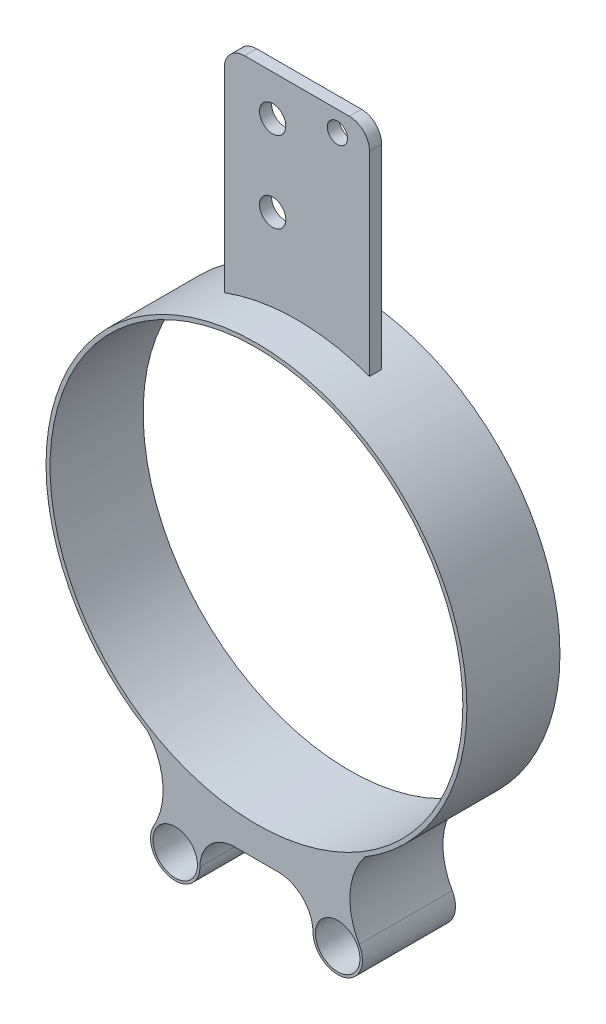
ISO-10303-21;
HEADER;
FILE_DESCRIPTION(('STEP AP214'),'2;1');
FILE_NAME('part.step','',(''),(''),'','','');
FILE_SCHEMA(('AUTOMOTIVE_DESIGN { 1 0 10303 214 1 1 1 1 }'));
ENDSEC;
DATA;
#1=APPLICATION_CONTEXT('core data for automotive mechanical design processes');
#2=APPLICATION_PROTOCOL_DEFINITION('international standard','automotive_design',2000,#1);
#3=PRODUCT_CONTEXT('',#1,'mechanical');
#4=PRODUCT('Part','Part','',(#3));
#5=PRODUCT_RELATED_PRODUCT_CATEGORY('part','',(#4));
#6=PRODUCT_DEFINITION_FORMATION('','',#4);
#7=PRODUCT_DEFINITION_CONTEXT('part definition',#1,'design');
#8=PRODUCT_DEFINITION('design','',#6,#7);
#9=PRODUCT_DEFINITION_SHAPE('','',#8);
#10=(LENGTH_UNIT() NAMED_UNIT(*) SI_UNIT(.MILLI.,.METRE.));
#11=(NAMED_UNIT(*) PLANE_ANGLE_UNIT() SI_UNIT($,.RADIAN.));
#12=(NAMED_UNIT(*) SI_UNIT($,.STERADIAN.) SOLID_ANGLE_UNIT());
#13=UNCERTAINTY_MEASURE_WITH_UNIT(LENGTH_MEASURE(1.E-05),#10,'distance_accuracy_value','');
#14=(GEOMETRIC_REPRESENTATION_CONTEXT(3) GLOBAL_UNCERTAINTY_ASSIGNED_CONTEXT((#13)) GLOBAL_UNIT_ASSIGNED_CONTEXT((#10,
#11,#12)) REPRESENTATION_CONTEXT('',''));
#15=CARTESIAN_POINT('',(0.,0.,0.));
#16=DIRECTION('',(0.,0.,1.));
#17=DIRECTION('',(1.,0.,0.));
#18=AXIS2_PLACEMENT_3D('',#15,#16,#17);
#19=CARTESIAN_POINT('',(-5.33951167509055,-67.1478656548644,23.));
#20=DIRECTION('',(0.,0.,1.));
#21=DIRECTION('',(1.,0.,0.));
#22=AXIS2_PLACEMENT_3D('',#19,#20,#21);
#23=PLANE('',#22);
#24=CARTESIAN_POINT('',(20.074423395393,-67.0303673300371,23.));
#25=DIRECTION('',(0.,0.,1.));
#26=DIRECTION('',(1.,0.,0.));
#27=AXIS2_PLACEMENT_3D('',#24,#25,#26);
#28=CIRCLE('',#27,5.5);
#29=CARTESIAN_POINT('',(25.574423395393,-67.0303673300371,23.));
#30=VERTEX_POINT('',#29);
#31=EDGE_CURVE('E234',#30,#30,#28,.T.);
#32=ORIENTED_EDGE('',*,*,#31,.F.);
#33=EDGE_LOOP('',(#32));
#34=FACE_BOUND('',#33,.T.);
#35=CARTESIAN_POINT('',(-20.074423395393,-67.0303673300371,23.));
#36=DIRECTION('',(0.,0.,1.));
#37=DIRECTION('',(1.,0.,0.));
#38=AXIS2_PLACEMENT_3D('',#35,#36,#37);
#39=CIRCLE('',#38,5.5);
#40=CARTESIAN_POINT('',(-14.574423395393,-67.0303673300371,23.));
#41=VERTEX_POINT('',#40);
#42=EDGE_CURVE('E223',#41,#41,#39,.T.);
#43=ORIENTED_EDGE('',*,*,#42,.F.);
#44=EDGE_LOOP('',(#43));
#45=FACE_BOUND('',#44,.T.);
#46=CARTESIAN_POINT('',(-5.33951167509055,-67.1478656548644,23.));
#47=DIRECTION('',(0.,0.,-1.));
#48=DIRECTION('',(1.,0.,0.));
#49=AXIS2_PLACEMENT_3D('',#46,#47,#48);
#50=CIRCLE('',#49,8.62670734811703);
#51=CARTESIAN_POINT('',(-13.9659447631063,-67.0790772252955,23.));
#52=VERTEX_POINT('',#51);
#53=CARTESIAN_POINT('',(-5.26383092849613,-58.5214902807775,23.));
#54=VERTEX_POINT('',#53);
#55=EDGE_CURVE('E168',#52,#54,#50,.T.);
#56=ORIENTED_EDGE('',*,*,#55,.T.);
#57=DIRECTION('',(1.,0.,0.));
#58=VECTOR('',#57,1.);
#59=CARTESIAN_POINT('',(-5.26383092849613,-58.5214902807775,23.));
#60=LINE('',#59,#58);
#61=CARTESIAN_POINT('',(5.26383092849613,-58.5214902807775,23.));
#62=VERTEX_POINT('',#61);
#63=EDGE_CURVE('E171',#54,#62,#60,.T.);
#64=ORIENTED_EDGE('',*,*,#63,.T.);
#65=CARTESIAN_POINT('',(5.33951167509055,-67.1478656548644,23.));
#66=DIRECTION('',(0.,0.,-1.));
#67=DIRECTION('',(-1.,0.,0.));
#68=AXIS2_PLACEMENT_3D('',#65,#66,#67);
#69=CIRCLE('',#68,8.62670734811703);
#70=CARTESIAN_POINT('',(13.9659447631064,-67.0790772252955,23.));
#71=VERTEX_POINT('',#70);
#72=EDGE_CURVE('E174',#62,#71,#69,.T.);
#73=ORIENTED_EDGE('',*,*,#72,.T.);
#74=CARTESIAN_POINT('',(20.074423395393,-67.0303673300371,23.));
#75=DIRECTION('',(0.,0.,1.));
#76=DIRECTION('',(1.,0.,0.));
#77=AXIS2_PLACEMENT_3D('',#74,#75,#76);
#78=CIRCLE('',#77,6.10867283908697);
#79=CARTESIAN_POINT('',(25.3779090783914,-63.9990436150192,23.));
#80=VERTEX_POINT('',#79);
#81=EDGE_CURVE('E176',#71,#80,#78,.T.);
#82=ORIENTED_EDGE('',*,*,#81,.T.);
#83=CARTESIAN_POINT('',(40.512535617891,-55.3485154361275,23.));
#84=DIRECTION('',(0.,0.,-1.));
#85=DIRECTION('',(-1.,0.,0.));
#86=AXIS2_PLACEMENT_3D('',#83,#84,#85);
#87=CIRCLE('',#86,17.432399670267);
#88=CARTESIAN_POINT('',(26.834522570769,-44.5410866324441,23.));
#89=VERTEX_POINT('',#88);
#90=EDGE_CURVE('E178',#80,#89,#87,.T.);
#91=ORIENTED_EDGE('',*,*,#90,.T.);
#92=CARTESIAN_POINT('',(0.,0.,23.));
#93=DIRECTION('',(0.,0.,1.));
#94=DIRECTION('',(1.,0.,0.));
#95=AXIS2_PLACEMENT_3D('',#92,#93,#94);
#96=CIRCLE('',#95,52.);
#97=CARTESIAN_POINT('',(-26.834522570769,-44.5410866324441,23.));
#98=VERTEX_POINT('',#97);
#99=EDGE_CURVE('E180',#89,#98,#96,.T.);
#100=ORIENTED_EDGE('',*,*,#99,.T.);
#101=CARTESIAN_POINT('',(-40.512535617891,-55.3485154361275,23.));
#102=DIRECTION('',(0.,0.,-1.));
#103=DIRECTION('',(1.,0.,0.));
#104=AXIS2_PLACEMENT_3D('',#101,#102,#103);
#105=CIRCLE('',#104,17.432399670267);
#106=CARTESIAN_POINT('',(-25.3779090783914,-63.9990436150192,23.));
#107=VERTEX_POINT('',#106);
#108=EDGE_CURVE('E182',#98,#107,#105,.T.);
#109=ORIENTED_EDGE('',*,*,#108,.T.);
#110=CARTESIAN_POINT('',(-20.074423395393,-67.0303673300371,23.));
#111=DIRECTION('',(0.,0.,1.));
#112=DIRECTION('',(-1.,0.,0.));
#113=AXIS2_PLACEMENT_3D('',#110,#111,#112);
#114=CIRCLE('',#113,6.10867283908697);
#115=EDGE_CURVE('E184',#107,#52,#114,.T.);
#116=ORIENTED_EDGE('',*,*,#115,.T.);
#117=EDGE_LOOP('',(#56,#64,#73,#82,#91,#100,#109,#116));
#118=FACE_BOUND('',#117,.T.);
#119=CARTESIAN_POINT('',(0.,0.,23.));
#120=DIRECTION('',(0.,0.,1.));
#121=DIRECTION('',(1.,0.,0.));
#122=AXIS2_PLACEMENT_3D('',#119,#120,#121);
#123=CIRCLE('',#122,51.);
#124=CARTESIAN_POINT('',(51.,0.,23.));
#125=VERTEX_POINT('',#124);
#126=EDGE_CURVE('E159',#125,#125,#123,.T.);
#127=ORIENTED_EDGE('',*,*,#126,.F.);
#128=EDGE_LOOP('',(#127));
#129=FACE_BOUND('',#128,.T.);
#130=ADVANCED_FACE('F33',(#34,#45,#118,#129),#23,.T.);
#131=CARTESIAN_POINT('',(-5.33951167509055,-67.1478656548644,0.));
#132=DIRECTION('',(0.,0.,1.));
#133=DIRECTION('',(1.,0.,0.));
#134=AXIS2_PLACEMENT_3D('',#131,#132,#133);
#135=PLANE('',#134);
#136=CARTESIAN_POINT('',(20.074423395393,-67.0303673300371,0.));
#137=DIRECTION('',(0.,0.,1.));
#138=DIRECTION('',(1.,0.,0.));
#139=AXIS2_PLACEMENT_3D('',#136,#137,#138);
#140=CIRCLE('',#139,5.5);
#141=CARTESIAN_POINT('',(25.574423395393,-67.0303673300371,0.));
#142=VERTEX_POINT('',#141);
#143=EDGE_CURVE('E37',#142,#142,#140,.T.);
#144=ORIENTED_EDGE('',*,*,#143,.T.);
#145=EDGE_LOOP('',(#144));
#146=FACE_BOUND('',#145,.T.);
#147=CARTESIAN_POINT('',(-20.074423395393,-67.0303673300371,0.));
#148=DIRECTION('',(0.,0.,1.));
#149=DIRECTION('',(1.,0.,0.));
#150=AXIS2_PLACEMENT_3D('',#147,#148,#149);
#151=CIRCLE('',#150,5.5);
#152=CARTESIAN_POINT('',(-14.574423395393,-67.0303673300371,0.));
#153=VERTEX_POINT('',#152);
#154=EDGE_CURVE('E220',#153,#153,#151,.T.);
#155=ORIENTED_EDGE('',*,*,#154,.T.);
#156=EDGE_LOOP('',(#155));
#157=FACE_BOUND('',#156,.T.);
#158=CARTESIAN_POINT('',(-5.33951167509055,-67.1478656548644,0.));
#159=DIRECTION('',(0.,0.,-1.));
#160=DIRECTION('',(1.,0.,0.));
#161=AXIS2_PLACEMENT_3D('',#158,#159,#160);
#162=CIRCLE('',#161,8.62670734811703);
#163=CARTESIAN_POINT('',(-13.9659447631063,-67.0790772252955,0.));
#164=VERTEX_POINT('',#163);
#165=CARTESIAN_POINT('',(-5.26383092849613,-58.5214902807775,0.));
#166=VERTEX_POINT('',#165);
#167=EDGE_CURVE('E166',#164,#166,#162,.T.);
#168=ORIENTED_EDGE('',*,*,#167,.F.);
#169=CARTESIAN_POINT('',(-20.074423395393,-67.0303673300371,0.));
#170=DIRECTION('',(0.,0.,1.));
#171=DIRECTION('',(-1.,0.,0.));
#172=AXIS2_PLACEMENT_3D('',#169,#170,#171);
#173=CIRCLE('',#172,6.10867283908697);
#174=CARTESIAN_POINT('',(-25.3779090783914,-63.9990436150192,0.));
#175=VERTEX_POINT('',#174);
#176=EDGE_CURVE('E172',#175,#164,#173,.T.);
#177=ORIENTED_EDGE('',*,*,#176,.F.);
#178=CARTESIAN_POINT('',(-40.512535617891,-55.3485154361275,0.));
#179=DIRECTION('',(0.,0.,-1.));
#180=DIRECTION('',(1.,0.,0.));
#181=AXIS2_PLACEMENT_3D('',#178,#179,#180);
#182=CIRCLE('',#181,17.432399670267);
#183=CARTESIAN_POINT('',(-26.834522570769,-44.5410866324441,0.));
#184=VERTEX_POINT('',#183);
#185=EDGE_CURVE('E199',#184,#175,#182,.T.);
#186=ORIENTED_EDGE('',*,*,#185,.F.);
#187=CARTESIAN_POINT('',(0.,0.,0.));
#188=DIRECTION('',(0.,0.,1.));
#189=DIRECTION('',(1.,0.,0.));
#190=AXIS2_PLACEMENT_3D('',#187,#188,#189);
#191=CIRCLE('',#190,52.);
#192=CARTESIAN_POINT('',(26.834522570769,-44.5410866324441,0.));
#193=VERTEX_POINT('',#192);
#194=EDGE_CURVE('E197',#193,#184,#191,.T.);
#195=ORIENTED_EDGE('',*,*,#194,.F.);
#196=CARTESIAN_POINT('',(40.512535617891,-55.3485154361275,0.));
#197=DIRECTION('',(0.,0.,-1.));
#198=DIRECTION('',(-1.,0.,0.));
#199=AXIS2_PLACEMENT_3D('',#196,#197,#198);
#200=CIRCLE('',#199,17.432399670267);
#201=CARTESIAN_POINT('',(25.3779090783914,-63.9990436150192,0.));
#202=VERTEX_POINT('',#201);
#203=EDGE_CURVE('E195',#202,#193,#200,.T.);
#204=ORIENTED_EDGE('',*,*,#203,.F.);
#205=CARTESIAN_POINT('',(20.074423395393,-67.0303673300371,0.));
#206=DIRECTION('',(0.,0.,1.));
#207=DIRECTION('',(1.,0.,0.));
#208=AXIS2_PLACEMENT_3D('',#205,#206,#207);
#209=CIRCLE('',#208,6.10867283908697);
#210=CARTESIAN_POINT('',(13.9659447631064,-67.0790772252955,0.));
#211=VERTEX_POINT('',#210);
#212=EDGE_CURVE('E193',#211,#202,#209,.T.);
#213=ORIENTED_EDGE('',*,*,#212,.F.);
#214=CARTESIAN_POINT('',(5.33951167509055,-67.1478656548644,0.));
#215=DIRECTION('',(0.,0.,-1.));
#216=DIRECTION('',(-1.,0.,0.));
#217=AXIS2_PLACEMENT_3D('',#214,#215,#216);
#218=CIRCLE('',#217,8.62670734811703);
#219=CARTESIAN_POINT('',(5.26383092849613,-58.5214902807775,0.));
#220=VERTEX_POINT('',#219);
#221=EDGE_CURVE('E191',#220,#211,#218,.T.);
#222=ORIENTED_EDGE('',*,*,#221,.F.);
#223=DIRECTION('',(1.,0.,0.));
#224=VECTOR('',#223,1.);
#225=CARTESIAN_POINT('',(-5.26383092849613,-58.5214902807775,0.));
#226=LINE('',#225,#224);
#227=EDGE_CURVE('E189',#166,#220,#226,.T.);
#228=ORIENTED_EDGE('',*,*,#227,.F.);
#229=EDGE_LOOP('',(#168,#177,#186,#195,#204,#213,#222,#228));
#230=FACE_BOUND('',#229,.T.);
#231=CARTESIAN_POINT('',(0.,0.,0.));
#232=DIRECTION('',(0.,0.,1.));
#233=DIRECTION('',(1.,0.,0.));
#234=AXIS2_PLACEMENT_3D('',#231,#232,#233);
#235=CIRCLE('',#234,51.);
#236=CARTESIAN_POINT('',(51.,0.,0.));
#237=VERTEX_POINT('',#236);
#238=EDGE_CURVE('E156',#237,#237,#235,.T.);
#239=ORIENTED_EDGE('',*,*,#238,.T.);
#240=EDGE_LOOP('',(#239));
#241=FACE_BOUND('',#240,.T.);
#242=ADVANCED_FACE('F299',(#146,#157,#230,#241),#135,.F.);
#243=CARTESIAN_POINT('',(-5.33951167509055,-67.1478656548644,23.));
#244=DIRECTION('',(0.,0.,-1.));
#245=DIRECTION('',(-1.,0.,0.));
#246=AXIS2_PLACEMENT_3D('',#243,#244,#245);
#247=CYLINDRICAL_SURFACE('',#246,8.62670734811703);
#248=ORIENTED_EDGE('',*,*,#167,.T.);
#249=DIRECTION('',(0.,0.,-1.));
#250=VECTOR('',#249,1.);
#251=CARTESIAN_POINT('',(-5.26383092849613,-58.5214902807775,23.));
#252=LINE('',#251,#250);
#253=EDGE_CURVE('E11',#54,#166,#252,.T.);
#254=ORIENTED_EDGE('',*,*,#253,.F.);
#255=ORIENTED_EDGE('',*,*,#55,.F.);
#256=DIRECTION('',(0.,0.,-1.));
#257=VECTOR('',#256,1.);
#258=CARTESIAN_POINT('',(-13.9659447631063,-67.0790772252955,23.));
#259=LINE('',#258,#257);
#260=EDGE_CURVE('E186',#52,#164,#259,.T.);
#261=ORIENTED_EDGE('',*,*,#260,.T.);
#262=EDGE_LOOP('',(#248,#254,#255,#261));
#263=FACE_BOUND('',#262,.T.);
#264=ADVANCED_FACE('F35',(#263),#247,.F.);
#265=CARTESIAN_POINT('',(-5.26383092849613,-58.5214902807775,23.));
#266=DIRECTION('',(0.,1.,0.));
#267=DIRECTION('',(0.,0.,1.));
#268=AXIS2_PLACEMENT_3D('',#265,#266,#267);
#269=PLANE('',#268);
#270=ORIENTED_EDGE('',*,*,#227,.T.);
#271=DIRECTION('',(0.,0.,-1.));
#272=VECTOR('',#271,1.);
#273=CARTESIAN_POINT('',(5.26383092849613,-58.5214902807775,23.));
#274=LINE('',#273,#272);
#275=EDGE_CURVE('E42',#62,#220,#274,.T.);
#276=ORIENTED_EDGE('',*,*,#275,.F.);
#277=ORIENTED_EDGE('',*,*,#63,.F.);
#278=ORIENTED_EDGE('',*,*,#253,.T.);
#279=EDGE_LOOP('',(#270,#276,#277,#278));
#280=FACE_BOUND('',#279,.T.);
#281=ADVANCED_FACE('F334',(#280),#269,.F.);
#282=CARTESIAN_POINT('',(5.33951167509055,-67.1478656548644,23.));
#283=DIRECTION('',(0.,0.,-1.));
#284=DIRECTION('',(-1.,0.,0.));
#285=AXIS2_PLACEMENT_3D('',#282,#283,#284);
#286=CYLINDRICAL_SURFACE('',#285,8.62670734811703);
#287=ORIENTED_EDGE('',*,*,#221,.T.);
#288=DIRECTION('',(0.,0.,-1.));
#289=VECTOR('',#288,1.);
#290=CARTESIAN_POINT('',(13.9659447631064,-67.0790772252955,23.));
#291=LINE('',#290,#289);
#292=EDGE_CURVE('E216',#71,#211,#291,.T.);
#293=ORIENTED_EDGE('',*,*,#292,.F.);
#294=ORIENTED_EDGE('',*,*,#72,.F.);
#295=ORIENTED_EDGE('',*,*,#275,.T.);
#296=EDGE_LOOP('',(#287,#293,#294,#295));
#297=FACE_BOUND('',#296,.T.);
#298=ADVANCED_FACE('F331',(#297),#286,.F.);
#299=CARTESIAN_POINT('',(20.074423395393,-67.0303673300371,23.));
#300=DIRECTION('',(0.,0.,-1.));
#301=DIRECTION('',(-1.,0.,0.));
#302=AXIS2_PLACEMENT_3D('',#299,#300,#301);
#303=CYLINDRICAL_SURFACE('',#302,6.10867283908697);
#304=ORIENTED_EDGE('',*,*,#212,.T.);
#305=DIRECTION('',(0.,0.,-1.));
#306=VECTOR('',#305,1.);
#307=CARTESIAN_POINT('',(25.3779090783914,-63.9990436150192,23.));
#308=LINE('',#307,#306);
#309=EDGE_CURVE('E213',#80,#202,#308,.T.);
#310=ORIENTED_EDGE('',*,*,#309,.F.);
#311=ORIENTED_EDGE('',*,*,#81,.F.);
#312=ORIENTED_EDGE('',*,*,#292,.T.);
#313=EDGE_LOOP('',(#304,#310,#311,#312));
#314=FACE_BOUND('',#313,.T.);
#315=ADVANCED_FACE('F327',(#314),#303,.T.);
#316=CARTESIAN_POINT('',(40.512535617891,-55.3485154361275,23.));
#317=DIRECTION('',(0.,0.,-1.));
#318=DIRECTION('',(-1.,0.,0.));
#319=AXIS2_PLACEMENT_3D('',#316,#317,#318);
#320=CYLINDRICAL_SURFACE('',#319,17.432399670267);
#321=ORIENTED_EDGE('',*,*,#203,.T.);
#322=DIRECTION('',(0.,0.,-1.));
#323=VECTOR('',#322,1.);
#324=CARTESIAN_POINT('',(26.834522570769,-44.5410866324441,23.));
#325=LINE('',#324,#323);
#326=EDGE_CURVE('E210',#89,#193,#325,.T.);
#327=ORIENTED_EDGE('',*,*,#326,.F.);
#328=ORIENTED_EDGE('',*,*,#90,.F.);
#329=ORIENTED_EDGE('',*,*,#309,.T.);
#330=EDGE_LOOP('',(#321,#327,#328,#329));
#331=FACE_BOUND('',#330,.T.);
#332=ADVANCED_FACE('F324',(#331),#320,.F.);
#333=CARTESIAN_POINT('',(0.,0.,23.));
#334=DIRECTION('',(0.,0.,-1.));
#335=DIRECTION('',(-1.,0.,0.));
#336=AXIS2_PLACEMENT_3D('',#333,#334,#335);
#337=CYLINDRICAL_SURFACE('',#336,52.);
#338=DIRECTION('',(0.,0.,-1.));
#339=VECTOR('',#338,1.);
#340=CARTESIAN_POINT('',(17.9396464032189,48.807469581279,13.));
#341=LINE('',#340,#339);
#342=CARTESIAN_POINT('',(17.9396464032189,48.807469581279,13.));
#343=VERTEX_POINT('',#342);
#344=CARTESIAN_POINT('',(17.9396464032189,48.807469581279,10.));
#345=VERTEX_POINT('',#344);
#346=EDGE_CURVE('E50',#343,#345,#341,.T.);
#347=ORIENTED_EDGE('',*,*,#346,.F.);
#348=CARTESIAN_POINT('',(0.,0.,13.));
#349=DIRECTION('',(0.,0.,1.));
#350=DIRECTION('',(1.,0.,0.));
#351=AXIS2_PLACEMENT_3D('',#348,#349,#350);
#352=CIRCLE('',#351,52.);
#353=CARTESIAN_POINT('',(-17.9396464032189,48.807469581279,13.));
#354=VERTEX_POINT('',#353);
#355=EDGE_CURVE('E55',#343,#354,#352,.T.);
#356=ORIENTED_EDGE('',*,*,#355,.T.);
#357=DIRECTION('',(0.,0.,-1.));
#358=VECTOR('',#357,1.);
#359=CARTESIAN_POINT('',(-17.9396464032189,48.807469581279,13.));
#360=LINE('',#359,#358);
#361=CARTESIAN_POINT('',(-17.9396464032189,48.807469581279,10.));
#362=VERTEX_POINT('',#361);
#363=EDGE_CURVE('E272',#354,#362,#360,.T.);
#364=ORIENTED_EDGE('',*,*,#363,.T.);
#365=CARTESIAN_POINT('',(0.,0.,10.));
#366=DIRECTION('',(0.,0.,1.));
#367=DIRECTION('',(1.,0.,0.));
#368=AXIS2_PLACEMENT_3D('',#365,#366,#367);
#369=CIRCLE('',#368,52.);
#370=EDGE_CURVE('E241',#345,#362,#369,.T.);
#371=ORIENTED_EDGE('',*,*,#370,.F.);
#372=EDGE_LOOP('',(#347,#356,#364,#371));
#373=FACE_BOUND('',#372,.T.);
#374=ORIENTED_EDGE('',*,*,#194,.T.);
#375=DIRECTION('',(0.,0.,-1.));
#376=VECTOR('',#375,1.);
#377=CARTESIAN_POINT('',(-26.834522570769,-44.5410866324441,23.));
#378=LINE('',#377,#376);
#379=EDGE_CURVE('E207',#98,#184,#378,.T.);
#380=ORIENTED_EDGE('',*,*,#379,.F.);
#381=ORIENTED_EDGE('',*,*,#99,.F.);
#382=ORIENTED_EDGE('',*,*,#326,.T.);
#383=EDGE_LOOP('',(#374,#380,#381,#382));
#384=FACE_BOUND('',#383,.T.);
#385=ADVANCED_FACE('F320',(#373,#384),#337,.T.);
#386=CARTESIAN_POINT('',(-40.512535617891,-55.3485154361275,23.));
#387=DIRECTION('',(0.,0.,-1.));
#388=DIRECTION('',(-1.,0.,0.));
#389=AXIS2_PLACEMENT_3D('',#386,#387,#388);
#390=CYLINDRICAL_SURFACE('',#389,17.432399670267);
#391=ORIENTED_EDGE('',*,*,#185,.T.);
#392=DIRECTION('',(0.,0.,-1.));
#393=VECTOR('',#392,1.);
#394=CARTESIAN_POINT('',(-25.3779090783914,-63.9990436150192,23.));
#395=LINE('',#394,#393);
#396=EDGE_CURVE('E204',#107,#175,#395,.T.);
#397=ORIENTED_EDGE('',*,*,#396,.F.);
#398=ORIENTED_EDGE('',*,*,#108,.F.);
#399=ORIENTED_EDGE('',*,*,#379,.T.);
#400=EDGE_LOOP('',(#391,#397,#398,#399));
#401=FACE_BOUND('',#400,.T.);
#402=ADVANCED_FACE('F316',(#401),#390,.F.);
#403=CARTESIAN_POINT('',(-20.074423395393,-67.0303673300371,23.));
#404=DIRECTION('',(0.,0.,-1.));
#405=DIRECTION('',(-1.,0.,0.));
#406=AXIS2_PLACEMENT_3D('',#403,#404,#405);
#407=CYLINDRICAL_SURFACE('',#406,6.10867283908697);
#408=ORIENTED_EDGE('',*,*,#176,.T.);
#409=ORIENTED_EDGE('',*,*,#260,.F.);
#410=ORIENTED_EDGE('',*,*,#115,.F.);
#411=ORIENTED_EDGE('',*,*,#396,.T.);
#412=EDGE_LOOP('',(#408,#409,#410,#411));
#413=FACE_BOUND('',#412,.T.);
#414=ADVANCED_FACE('F313',(#413),#407,.T.);
#415=CARTESIAN_POINT('',(0.,0.,23.));
#416=DIRECTION('',(0.,0.,-1.));
#417=DIRECTION('',(-1.,0.,0.));
#418=AXIS2_PLACEMENT_3D('',#415,#416,#417);
#419=CYLINDRICAL_SURFACE('',#418,51.);
#420=ORIENTED_EDGE('',*,*,#126,.T.);
#421=EDGE_LOOP('',(#420));
#422=FACE_BOUND('',#421,.T.);
#423=ORIENTED_EDGE('',*,*,#238,.F.);
#424=EDGE_LOOP('',(#423));
#425=FACE_BOUND('',#424,.T.);
#426=ADVANCED_FACE('F310',(#422,#425),#419,.F.);
#427=CARTESIAN_POINT('',(17.9396464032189,-115.899434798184,13.));
#428=DIRECTION('',(-1.,0.,0.));
#429=DIRECTION('',(0.,0.,1.));
#430=AXIS2_PLACEMENT_3D('',#427,#428,#429);
#431=PLANE('',#430);
#432=DIRECTION('',(0.,1.,0.));
#433=VECTOR('',#432,1.);
#434=CARTESIAN_POINT('',(17.9396464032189,-115.899434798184,10.));
#435=LINE('',#434,#433);
#436=CARTESIAN_POINT('',(17.9396464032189,97.,10.));
#437=VERTEX_POINT('',#436);
#438=EDGE_CURVE('E155',#345,#437,#435,.T.);
#439=ORIENTED_EDGE('',*,*,#438,.T.);
#440=DIRECTION('',(0.,0.,-1.));
#441=VECTOR('',#440,1.);
#442=CARTESIAN_POINT('',(17.9396464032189,97.,13.));
#443=LINE('',#442,#441);
#444=CARTESIAN_POINT('',(17.9396464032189,97.,13.));
#445=VERTEX_POINT('',#444);
#446=EDGE_CURVE('E139',#445,#437,#443,.T.);
#447=ORIENTED_EDGE('',*,*,#446,.F.);
#448=DIRECTION('',(0.,1.,0.));
#449=VECTOR('',#448,1.);
#450=CARTESIAN_POINT('',(17.9396464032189,-115.899434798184,13.));
#451=LINE('',#450,#449);
#452=EDGE_CURVE('E146',#343,#445,#451,.T.);
#453=ORIENTED_EDGE('',*,*,#452,.F.);
#454=ORIENTED_EDGE('',*,*,#346,.T.);
#455=EDGE_LOOP('',(#439,#447,#453,#454));
#456=FACE_BOUND('',#455,.T.);
#457=ADVANCED_FACE('F153',(#456),#431,.F.);
#458=CARTESIAN_POINT('',(12.9396464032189,97.,13.));
#459=DIRECTION('',(0.,0.,-1.));
#460=DIRECTION('',(-1.,0.,0.));
#461=AXIS2_PLACEMENT_3D('',#458,#459,#460);
#462=CYLINDRICAL_SURFACE('',#461,5.);
#463=CARTESIAN_POINT('',(12.9396464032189,97.,10.));
#464=DIRECTION('',(0.,0.,1.));
#465=DIRECTION('',(1.,0.,0.));
#466=AXIS2_PLACEMENT_3D('',#463,#464,#465);
#467=CIRCLE('',#466,5.);
#468=CARTESIAN_POINT('',(12.9396464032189,102.,10.));
#469=VERTEX_POINT('',#468);
#470=EDGE_CURVE('E259',#437,#469,#467,.T.);
#471=ORIENTED_EDGE('',*,*,#470,.T.);
#472=DIRECTION('',(0.,0.,-1.));
#473=VECTOR('',#472,1.);
#474=CARTESIAN_POINT('',(12.9396464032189,102.,13.));
#475=LINE('',#474,#473);
#476=CARTESIAN_POINT('',(12.9396464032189,102.,13.));
#477=VERTEX_POINT('',#476);
#478=EDGE_CURVE('E142',#477,#469,#475,.T.);
#479=ORIENTED_EDGE('',*,*,#478,.F.);
#480=CARTESIAN_POINT('',(12.9396464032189,97.,13.));
#481=DIRECTION('',(0.,0.,1.));
#482=DIRECTION('',(1.,0.,0.));
#483=AXIS2_PLACEMENT_3D('',#480,#481,#482);
#484=CIRCLE('',#483,5.);
#485=EDGE_CURVE('E135',#445,#477,#484,.T.);
#486=ORIENTED_EDGE('',*,*,#485,.F.);
#487=ORIENTED_EDGE('',*,*,#446,.T.);
#488=EDGE_LOOP('',(#471,#479,#486,#487));
#489=FACE_BOUND('',#488,.T.);
#490=ADVANCED_FACE('F137',(#489),#462,.T.);
#491=CARTESIAN_POINT('',(0.,102.,13.));
#492=DIRECTION('',(0.,-1.,0.));
#493=DIRECTION('',(0.,0.,-1.));
#494=AXIS2_PLACEMENT_3D('',#491,#492,#493);
#495=PLANE('',#494);
#496=DIRECTION('',(-1.,0.,0.));
#497=VECTOR('',#496,1.);
#498=CARTESIAN_POINT('',(0.,102.,10.));
#499=LINE('',#498,#497);
#500=CARTESIAN_POINT('',(-12.9396464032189,102.,10.));
#501=VERTEX_POINT('',#500);
#502=EDGE_CURVE('E261',#469,#501,#499,.T.);
#503=ORIENTED_EDGE('',*,*,#502,.T.);
#504=DIRECTION('',(0.,0.,-1.));
#505=VECTOR('',#504,1.);
#506=CARTESIAN_POINT('',(-12.9396464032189,102.,13.));
#507=LINE('',#506,#505);
#508=CARTESIAN_POINT('',(-12.9396464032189,102.,13.));
#509=VERTEX_POINT('',#508);
#510=EDGE_CURVE('E161',#509,#501,#507,.T.);
#511=ORIENTED_EDGE('',*,*,#510,.F.);
#512=DIRECTION('',(-1.,0.,0.));
#513=VECTOR('',#512,1.);
#514=CARTESIAN_POINT('',(0.,102.,13.));
#515=LINE('',#514,#513);
#516=EDGE_CURVE('E145',#477,#509,#515,.T.);
#517=ORIENTED_EDGE('',*,*,#516,.F.);
#518=ORIENTED_EDGE('',*,*,#478,.T.);
#519=EDGE_LOOP('',(#503,#511,#517,#518));
#520=FACE_BOUND('',#519,.T.);
#521=ADVANCED_FACE('F289',(#520),#495,.F.);
#522=CARTESIAN_POINT('',(-12.9396464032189,97.,13.));
#523=DIRECTION('',(0.,0.,-1.));
#524=DIRECTION('',(-1.,0.,0.));
#525=AXIS2_PLACEMENT_3D('',#522,#523,#524);
#526=CYLINDRICAL_SURFACE('',#525,5.);
#527=CARTESIAN_POINT('',(-12.9396464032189,97.,10.));
#528=DIRECTION('',(0.,0.,1.));
#529=DIRECTION('',(1.,0.,0.));
#530=AXIS2_PLACEMENT_3D('',#527,#528,#529);
#531=CIRCLE('',#530,5.);
#532=CARTESIAN_POINT('',(-17.9396464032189,97.,10.));
#533=VERTEX_POINT('',#532);
#534=EDGE_CURVE('E263',#501,#533,#531,.T.);
#535=ORIENTED_EDGE('',*,*,#534,.T.);
#536=DIRECTION('',(0.,0.,-1.));
#537=VECTOR('',#536,1.);
#538=CARTESIAN_POINT('',(-17.9396464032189,97.,13.));
#539=LINE('',#538,#537);
#540=CARTESIAN_POINT('',(-17.9396464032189,97.,13.));
#541=VERTEX_POINT('',#540);
#542=EDGE_CURVE('E274',#541,#533,#539,.T.);
#543=ORIENTED_EDGE('',*,*,#542,.F.);
#544=CARTESIAN_POINT('',(-12.9396464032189,97.,13.));
#545=DIRECTION('',(0.,0.,1.));
#546=DIRECTION('',(1.,0.,0.));
#547=AXIS2_PLACEMENT_3D('',#544,#545,#546);
#548=CIRCLE('',#547,5.);
#549=EDGE_CURVE('E247',#509,#541,#548,.T.);
#550=ORIENTED_EDGE('',*,*,#549,.F.);
#551=ORIENTED_EDGE('',*,*,#510,.T.);
#552=EDGE_LOOP('',(#535,#543,#550,#551));
#553=FACE_BOUND('',#552,.T.);
#554=ADVANCED_FACE('F280',(#553),#526,.T.);
#555=CARTESIAN_POINT('',(-17.9396464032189,-115.899434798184,13.));
#556=DIRECTION('',(-1.,0.,0.));
#557=DIRECTION('',(0.,0.,1.));
#558=AXIS2_PLACEMENT_3D('',#555,#556,#557);
#559=PLANE('',#558);
#560=DIRECTION('',(0.,1.,0.));
#561=VECTOR('',#560,1.);
#562=CARTESIAN_POINT('',(-17.9396464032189,-115.899434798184,10.));
#563=LINE('',#562,#561);
#564=EDGE_CURVE('E266',#362,#533,#563,.T.);
#565=ORIENTED_EDGE('',*,*,#564,.F.);
#566=ORIENTED_EDGE('',*,*,#363,.F.);
#567=DIRECTION('',(0.,1.,0.));
#568=VECTOR('',#567,1.);
#569=CARTESIAN_POINT('',(-17.9396464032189,-115.899434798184,13.));
#570=LINE('',#569,#568);
#571=EDGE_CURVE('E249',#354,#541,#570,.T.);
#572=ORIENTED_EDGE('',*,*,#571,.T.);
#573=ORIENTED_EDGE('',*,*,#542,.T.);
#574=EDGE_LOOP('',(#565,#566,#572,#573));
#575=FACE_BOUND('',#574,.T.);
#576=ADVANCED_FACE('F288',(#575),#559,.T.);
#577=CARTESIAN_POINT('',(10.,97.,13.));
#578=DIRECTION('',(0.,0.,-1.));
#579=DIRECTION('',(-1.,0.,0.));
#580=AXIS2_PLACEMENT_3D('',#577,#578,#579);
#581=CYLINDRICAL_SURFACE('',#580,2.5);
#582=CARTESIAN_POINT('',(10.,97.,13.));
#583=DIRECTION('',(0.,0.,1.));
#584=DIRECTION('',(1.,0.,0.));
#585=AXIS2_PLACEMENT_3D('',#582,#583,#584);
#586=CIRCLE('',#585,2.5);
#587=CARTESIAN_POINT('',(12.5,97.,13.));
#588=VERTEX_POINT('',#587);
#589=EDGE_CURVE('E151',#588,#588,#586,.T.);
#590=ORIENTED_EDGE('',*,*,#589,.T.);
#591=EDGE_LOOP('',(#590));
#592=FACE_BOUND('',#591,.T.);
#593=CARTESIAN_POINT('',(10.,97.,10.));
#594=DIRECTION('',(0.,0.,1.));
#595=DIRECTION('',(1.,0.,0.));
#596=AXIS2_PLACEMENT_3D('',#593,#594,#595);
#597=CIRCLE('',#596,2.5);
#598=CARTESIAN_POINT('',(12.5,97.,10.));
#599=VERTEX_POINT('',#598);
#600=EDGE_CURVE('E255',#599,#599,#597,.T.);
#601=ORIENTED_EDGE('',*,*,#600,.F.);
#602=EDGE_LOOP('',(#601));
#603=FACE_BOUND('',#602,.T.);
#604=ADVANCED_FACE('F381',(#592,#603),#581,.F.);
#605=CARTESIAN_POINT('',(-6.,92.,13.));
#606=DIRECTION('',(0.,0.,-1.));
#607=DIRECTION('',(-1.,0.,0.));
#608=AXIS2_PLACEMENT_3D('',#605,#606,#607);
#609=CYLINDRICAL_SURFACE('',#608,3.25);
#610=CARTESIAN_POINT('',(-6.,92.,13.));
#611=DIRECTION('',(0.,0.,1.));
#612=DIRECTION('',(1.,0.,0.));
#613=AXIS2_PLACEMENT_3D('',#610,#611,#612);
#614=CIRCLE('',#613,3.25);
#615=CARTESIAN_POINT('',(-2.75,92.,13.));
#616=VERTEX_POINT('',#615);
#617=EDGE_CURVE('E240',#616,#616,#614,.T.);
#618=ORIENTED_EDGE('',*,*,#617,.T.);
#619=EDGE_LOOP('',(#618));
#620=FACE_BOUND('',#619,.T.);
#621=CARTESIAN_POINT('',(-6.,92.,10.));
#622=DIRECTION('',(0.,0.,1.));
#623=DIRECTION('',(1.,0.,0.));
#624=AXIS2_PLACEMENT_3D('',#621,#622,#623);
#625=CIRCLE('',#624,3.25);
#626=CARTESIAN_POINT('',(-2.75,92.,10.));
#627=VERTEX_POINT('',#626);
#628=EDGE_CURVE('E227',#627,#627,#625,.T.);
#629=ORIENTED_EDGE('',*,*,#628,.F.);
#630=EDGE_LOOP('',(#629));
#631=FACE_BOUND('',#630,.T.);
#632=ADVANCED_FACE('F384',(#620,#631),#609,.F.);
#633=CARTESIAN_POINT('',(-6.,72.,13.));
#634=DIRECTION('',(0.,0.,-1.));
#635=DIRECTION('',(-1.,0.,0.));
#636=AXIS2_PLACEMENT_3D('',#633,#634,#635);
#637=CYLINDRICAL_SURFACE('',#636,3.25);
#638=CARTESIAN_POINT('',(-6.,72.,13.));
#639=DIRECTION('',(0.,0.,1.));
#640=DIRECTION('',(1.,0.,0.));
#641=AXIS2_PLACEMENT_3D('',#638,#639,#640);
#642=CIRCLE('',#641,3.25);
#643=CARTESIAN_POINT('',(-2.75,72.,13.));
#644=VERTEX_POINT('',#643);
#645=EDGE_CURVE('E237',#644,#644,#642,.T.);
#646=ORIENTED_EDGE('',*,*,#645,.T.);
#647=EDGE_LOOP('',(#646));
#648=FACE_BOUND('',#647,.T.);
#649=CARTESIAN_POINT('',(-6.,72.,10.));
#650=DIRECTION('',(0.,0.,1.));
#651=DIRECTION('',(1.,0.,0.));
#652=AXIS2_PLACEMENT_3D('',#649,#650,#651);
#653=CIRCLE('',#652,3.25);
#654=CARTESIAN_POINT('',(-2.75,72.,10.));
#655=VERTEX_POINT('',#654);
#656=EDGE_CURVE('E222',#655,#655,#653,.T.);
#657=ORIENTED_EDGE('',*,*,#656,.F.);
#658=EDGE_LOOP('',(#657));
#659=FACE_BOUND('',#658,.T.);
#660=ADVANCED_FACE('F387',(#648,#659),#637,.F.);
#661=CARTESIAN_POINT('',(0.,-115.899434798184,13.));
#662=DIRECTION('',(0.,0.,1.));
#663=DIRECTION('',(1.,0.,0.));
#664=AXIS2_PLACEMENT_3D('',#661,#662,#663);
#665=PLANE('',#664);
#666=ORIENTED_EDGE('',*,*,#645,.F.);
#667=EDGE_LOOP('',(#666));
#668=FACE_BOUND('',#667,.T.);
#669=ORIENTED_EDGE('',*,*,#617,.F.);
#670=EDGE_LOOP('',(#669));
#671=FACE_BOUND('',#670,.T.);
#672=ORIENTED_EDGE('',*,*,#589,.F.);
#673=EDGE_LOOP('',(#672));
#674=FACE_BOUND('',#673,.T.);
#675=ORIENTED_EDGE('',*,*,#452,.T.);
#676=ORIENTED_EDGE('',*,*,#485,.T.);
#677=ORIENTED_EDGE('',*,*,#516,.T.);
#678=ORIENTED_EDGE('',*,*,#549,.T.);
#679=ORIENTED_EDGE('',*,*,#571,.F.);
#680=ORIENTED_EDGE('',*,*,#355,.F.);
#681=EDGE_LOOP('',(#675,#676,#677,#678,#679,#680));
#682=FACE_BOUND('',#681,.T.);
#683=ADVANCED_FACE('F148',(#668,#671,#674,#682),#665,.T.);
#684=CARTESIAN_POINT('',(0.,-115.899434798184,10.));
#685=DIRECTION('',(0.,0.,1.));
#686=DIRECTION('',(1.,0.,0.));
#687=AXIS2_PLACEMENT_3D('',#684,#685,#686);
#688=PLANE('',#687);
#689=ORIENTED_EDGE('',*,*,#656,.T.);
#690=EDGE_LOOP('',(#689));
#691=FACE_BOUND('',#690,.T.);
#692=ORIENTED_EDGE('',*,*,#628,.T.);
#693=EDGE_LOOP('',(#692));
#694=FACE_BOUND('',#693,.T.);
#695=ORIENTED_EDGE('',*,*,#600,.T.);
#696=EDGE_LOOP('',(#695));
#697=FACE_BOUND('',#696,.T.);
#698=ORIENTED_EDGE('',*,*,#438,.F.);
#699=ORIENTED_EDGE('',*,*,#370,.T.);
#700=ORIENTED_EDGE('',*,*,#564,.T.);
#701=ORIENTED_EDGE('',*,*,#534,.F.);
#702=ORIENTED_EDGE('',*,*,#502,.F.);
#703=ORIENTED_EDGE('',*,*,#470,.F.);
#704=EDGE_LOOP('',(#698,#699,#700,#701,#702,#703));
#705=FACE_BOUND('',#704,.T.);
#706=ADVANCED_FACE('F285',(#691,#694,#697,#705),#688,.F.);
#707=CARTESIAN_POINT('',(-20.074423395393,-67.0303673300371,-2.));
#708=DIRECTION('',(0.,0.,1.));
#709=DIRECTION('',(1.,0.,0.));
#710=AXIS2_PLACEMENT_3D('',#707,#708,#709);
#711=CYLINDRICAL_SURFACE('',#710,5.5);
#712=ORIENTED_EDGE('',*,*,#42,.T.);
#713=EDGE_LOOP('',(#712));
#714=FACE_BOUND('',#713,.T.);
#715=ORIENTED_EDGE('',*,*,#154,.F.);
#716=EDGE_LOOP('',(#715));
#717=FACE_BOUND('',#716,.T.);
#718=ADVANCED_FACE('F402',(#714,#717),#711,.F.);
#719=CARTESIAN_POINT('',(20.074423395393,-67.0303673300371,-2.));
#720=DIRECTION('',(0.,0.,1.));
#721=DIRECTION('',(1.,0.,0.));
#722=AXIS2_PLACEMENT_3D('',#719,#720,#721);
#723=CYLINDRICAL_SURFACE('',#722,5.5);
#724=ORIENTED_EDGE('',*,*,#31,.T.);
#725=EDGE_LOOP('',(#724));
#726=FACE_BOUND('',#725,.T.);
#727=ORIENTED_EDGE('',*,*,#143,.F.);
#728=EDGE_LOOP('',(#727));
#729=FACE_BOUND('',#728,.T.);
#730=ADVANCED_FACE('F412',(#726,#729),#723,.F.);
#731=CLOSED_SHELL('',(#130,#242,#264,#281,#298,#315,#332,#385,#402,#414,#426,#457,#490,#521,
#554,#576,#604,#632,#660,#683,#706,#718,#730));
#732=MANIFOLD_SOLID_BREP('B2',#731);
#733=ADVANCED_BREP_SHAPE_REPRESENTATION('',(#18,#732),#14);
#734=SHAPE_DEFINITION_REPRESENTATION(#9,#733);
ENDSEC;
END-ISO-10303-21;
